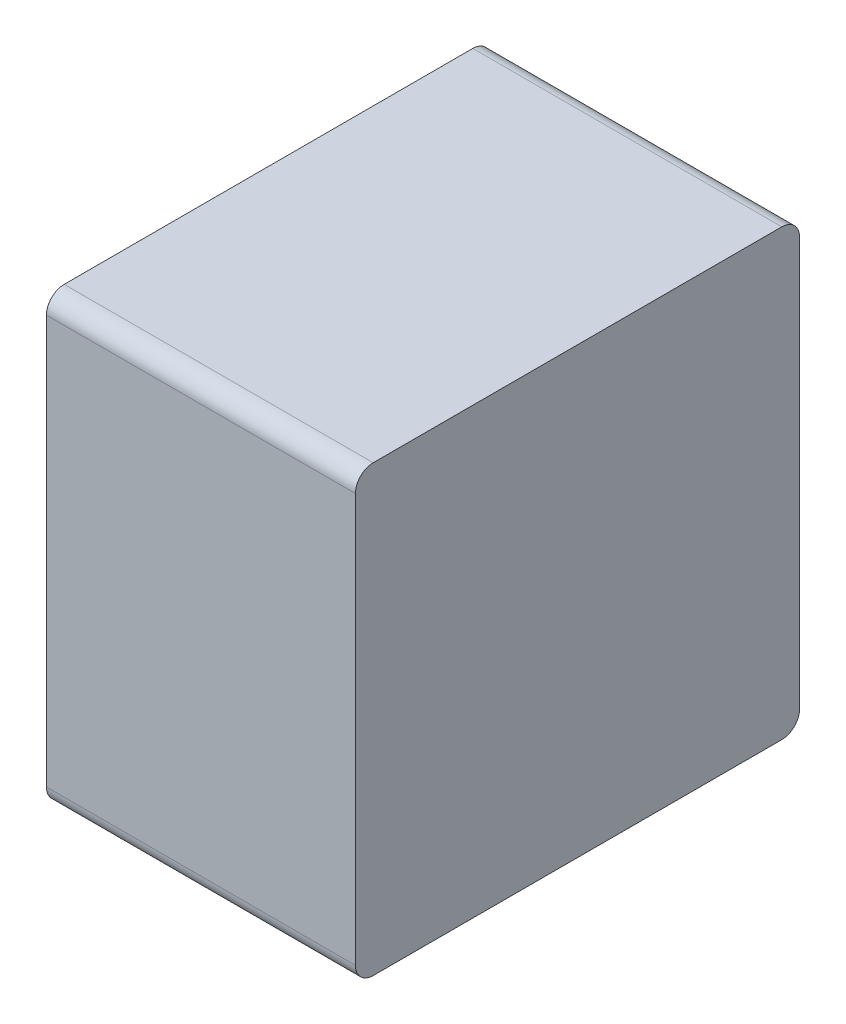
ISO-10303-21;
HEADER;
FILE_DESCRIPTION(('STEP AP214'),'2;1');
FILE_NAME('part.step','',(''),(''),'','','');
FILE_SCHEMA(('AUTOMOTIVE_DESIGN { 1 0 10303 214 1 1 1 1 }'));
ENDSEC;
DATA;
#1=APPLICATION_CONTEXT('core data for automotive mechanical design processes');
#2=APPLICATION_PROTOCOL_DEFINITION('international standard','automotive_design',2000,#1);
#3=PRODUCT_CONTEXT('',#1,'mechanical');
#4=PRODUCT('Part','Part','',(#3));
#5=PRODUCT_RELATED_PRODUCT_CATEGORY('part','',(#4));
#6=PRODUCT_DEFINITION_FORMATION('','',#4);
#7=PRODUCT_DEFINITION_CONTEXT('part definition',#1,'design');
#8=PRODUCT_DEFINITION('design','',#6,#7);
#9=PRODUCT_DEFINITION_SHAPE('','',#8);
#10=(LENGTH_UNIT() NAMED_UNIT(*) SI_UNIT(.MILLI.,.METRE.));
#11=(NAMED_UNIT(*) PLANE_ANGLE_UNIT() SI_UNIT($,.RADIAN.));
#12=(NAMED_UNIT(*) SI_UNIT($,.STERADIAN.) SOLID_ANGLE_UNIT());
#13=UNCERTAINTY_MEASURE_WITH_UNIT(LENGTH_MEASURE(1.E-05),#10,'distance_accuracy_value','');
#14=(GEOMETRIC_REPRESENTATION_CONTEXT(3) GLOBAL_UNCERTAINTY_ASSIGNED_CONTEXT((#13)) GLOBAL_UNIT_ASSIGNED_CONTEXT((#10,
#11,#12)) REPRESENTATION_CONTEXT('',''));
#15=CARTESIAN_POINT('',(0.,0.,0.));
#16=DIRECTION('',(0.,0.,1.));
#17=DIRECTION('',(1.,0.,0.));
#18=AXIS2_PLACEMENT_3D('',#15,#16,#17);
#19=CARTESIAN_POINT('',(222.032460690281,0.,50.0000000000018));
#20=DIRECTION('',(-1.,0.,0.));
#21=DIRECTION('',(0.,-1.,0.));
#22=AXIS2_PLACEMENT_3D('',#19,#20,#21);
#23=PLANE('',#22);
#24=CARTESIAN_POINT('',(222.032460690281,-57.5000000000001,55.));
#25=DIRECTION('',(-1.,0.,0.));
#26=DIRECTION('',(0.,0.,1.));
#27=AXIS2_PLACEMENT_3D('',#24,#25,#26);
#28=CIRCLE('',#27,4.99999999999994);
#29=CARTESIAN_POINT('',(222.032460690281,-57.5000000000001,50.0000000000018));
#30=VERTEX_POINT('',#29);
#31=CARTESIAN_POINT('',(222.032460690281,-62.5,55.));
#32=VERTEX_POINT('',#31);
#33=EDGE_CURVE('E84',#30,#32,#28,.T.);
#34=ORIENTED_EDGE('',*,*,#33,.T.);
#35=DIRECTION('',(0.,0.,1.));
#36=VECTOR('',#35,1.);
#37=CARTESIAN_POINT('',(222.032460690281,-62.5,112.500000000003));
#38=LINE('',#37,#36);
#39=CARTESIAN_POINT('',(222.032460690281,-62.5,170.000000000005));
#40=VERTEX_POINT('',#39);
#41=EDGE_CURVE('E79',#32,#40,#38,.T.);
#42=ORIENTED_EDGE('',*,*,#41,.T.);
#43=CARTESIAN_POINT('',(222.032460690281,-57.5,170.000000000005));
#44=DIRECTION('',(-1.,0.,0.));
#45=DIRECTION('',(0.,0.,1.));
#46=AXIS2_PLACEMENT_3D('',#43,#44,#45);
#47=CIRCLE('',#46,5.);
#48=CARTESIAN_POINT('',(222.032460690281,-57.5,175.000000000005));
#49=VERTEX_POINT('',#48);
#50=EDGE_CURVE('E20',#40,#49,#47,.T.);
#51=ORIENTED_EDGE('',*,*,#50,.T.);
#52=DIRECTION('',(0.,-1.,0.));
#53=VECTOR('',#52,1.);
#54=CARTESIAN_POINT('',(222.032460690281,0.,175.000000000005));
#55=LINE('',#54,#53);
#56=CARTESIAN_POINT('',(222.032460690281,57.5,175.000000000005));
#57=VERTEX_POINT('',#56);
#58=EDGE_CURVE('E105',#57,#49,#55,.T.);
#59=ORIENTED_EDGE('',*,*,#58,.F.);
#60=CARTESIAN_POINT('',(222.032460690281,57.4999999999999,170.000000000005));
#61=DIRECTION('',(-1.,0.,0.));
#62=DIRECTION('',(0.,0.,1.));
#63=AXIS2_PLACEMENT_3D('',#60,#61,#62);
#64=CIRCLE('',#63,5.00000000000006);
#65=CARTESIAN_POINT('',(222.032460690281,62.5,170.000000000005));
#66=VERTEX_POINT('',#65);
#67=EDGE_CURVE('E128',#57,#66,#64,.T.);
#68=ORIENTED_EDGE('',*,*,#67,.T.);
#69=DIRECTION('',(0.,0.,1.));
#70=VECTOR('',#69,1.);
#71=CARTESIAN_POINT('',(222.032460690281,62.5,112.500000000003));
#72=LINE('',#71,#70);
#73=CARTESIAN_POINT('',(222.032460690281,62.5,55.));
#74=VERTEX_POINT('',#73);
#75=EDGE_CURVE('E108',#74,#66,#72,.T.);
#76=ORIENTED_EDGE('',*,*,#75,.F.);
#77=CARTESIAN_POINT('',(222.032460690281,57.5,55.));
#78=DIRECTION('',(-1.,0.,0.));
#79=DIRECTION('',(0.,0.,1.));
#80=AXIS2_PLACEMENT_3D('',#77,#78,#79);
#81=CIRCLE('',#80,5.);
#82=CARTESIAN_POINT('',(222.032460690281,57.5,50.0000000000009));
#83=VERTEX_POINT('',#82);
#84=EDGE_CURVE('E114',#74,#83,#81,.T.);
#85=ORIENTED_EDGE('',*,*,#84,.T.);
#86=DIRECTION('',(0.,1.,0.));
#87=VECTOR('',#86,1.);
#88=CARTESIAN_POINT('',(222.032460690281,0.,50.0000000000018));
#89=LINE('',#88,#87);
#90=EDGE_CURVE('E112',#30,#83,#89,.T.);
#91=ORIENTED_EDGE('',*,*,#90,.F.);
#92=EDGE_LOOP('',(#34,#42,#51,#59,#68,#76,#85,#91));
#93=FACE_BOUND('',#92,.T.);
#94=ADVANCED_FACE('F16',(#93),#23,.T.);
#95=CARTESIAN_POINT('',(308.999999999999,-57.5,170.000000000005));
#96=DIRECTION('',(-1.,0.,0.));
#97=DIRECTION('',(0.,0.,1.));
#98=AXIS2_PLACEMENT_3D('',#95,#96,#97);
#99=CYLINDRICAL_SURFACE('',#98,5.);
#100=DIRECTION('',(1.,0.,0.));
#101=VECTOR('',#100,1.);
#102=CARTESIAN_POINT('',(235.500000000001,-57.5,175.000000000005));
#103=LINE('',#102,#101);
#104=CARTESIAN_POINT('',(308.999999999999,-57.5,175.000000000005));
#105=VERTEX_POINT('',#104);
#106=EDGE_CURVE('E94',#49,#105,#103,.T.);
#107=ORIENTED_EDGE('',*,*,#106,.F.);
#108=ORIENTED_EDGE('',*,*,#50,.F.);
#109=DIRECTION('',(1.,0.,0.));
#110=VECTOR('',#109,1.);
#111=CARTESIAN_POINT('',(265.51623034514,-62.5,170.000000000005));
#112=LINE('',#111,#110);
#113=CARTESIAN_POINT('',(308.999999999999,-62.5,170.000000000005));
#114=VERTEX_POINT('',#113);
#115=EDGE_CURVE('E88',#40,#114,#112,.T.);
#116=ORIENTED_EDGE('',*,*,#115,.T.);
#117=CARTESIAN_POINT('',(308.999999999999,-57.5,170.000000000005));
#118=DIRECTION('',(-1.,0.,0.));
#119=DIRECTION('',(0.,0.,1.));
#120=AXIS2_PLACEMENT_3D('',#117,#118,#119);
#121=CIRCLE('',#120,5.);
#122=EDGE_CURVE('E107',#105,#114,#121,.F.);
#123=ORIENTED_EDGE('',*,*,#122,.F.);
#124=EDGE_LOOP('',(#107,#108,#116,#123));
#125=FACE_BOUND('',#124,.T.);
#126=ADVANCED_FACE('F91',(#125),#99,.T.);
#127=CARTESIAN_POINT('',(265.51623034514,-62.5,112.500000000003));
#128=DIRECTION('',(0.,1.,0.));
#129=DIRECTION('',(0.,0.,1.));
#130=AXIS2_PLACEMENT_3D('',#127,#128,#129);
#131=PLANE('',#130);
#132=ORIENTED_EDGE('',*,*,#41,.F.);
#133=DIRECTION('',(-1.,0.,0.));
#134=VECTOR('',#133,1.);
#135=CARTESIAN_POINT('',(319.,-62.5,55.));
#136=LINE('',#135,#134);
#137=CARTESIAN_POINT('',(308.999999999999,-62.5,55.));
#138=VERTEX_POINT('',#137);
#139=EDGE_CURVE('E100',#32,#138,#136,.F.);
#140=ORIENTED_EDGE('',*,*,#139,.T.);
#141=DIRECTION('',(0.,0.,1.));
#142=VECTOR('',#141,1.);
#143=CARTESIAN_POINT('',(308.999999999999,-62.5,175.000000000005));
#144=LINE('',#143,#142);
#145=EDGE_CURVE('E98',#114,#138,#144,.F.);
#146=ORIENTED_EDGE('',*,*,#145,.F.);
#147=ORIENTED_EDGE('',*,*,#115,.F.);
#148=EDGE_LOOP('',(#132,#140,#146,#147));
#149=FACE_BOUND('',#148,.T.);
#150=ADVANCED_FACE('F96',(#149),#131,.F.);
#151=CARTESIAN_POINT('',(308.999999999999,-57.5000000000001,55.));
#152=DIRECTION('',(-1.,0.,0.));
#153=DIRECTION('',(0.,0.,1.));
#154=AXIS2_PLACEMENT_3D('',#151,#152,#153);
#155=CYLINDRICAL_SURFACE('',#154,4.99999999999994);
#156=DIRECTION('',(1.,0.,0.));
#157=VECTOR('',#156,1.);
#158=CARTESIAN_POINT('',(235.499999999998,-57.5,50.0000000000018));
#159=LINE('',#158,#157);
#160=CARTESIAN_POINT('',(308.999999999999,-57.5000000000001,50.0000000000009));
#161=VERTEX_POINT('',#160);
#162=EDGE_CURVE('E115',#161,#30,#159,.F.);
#163=ORIENTED_EDGE('',*,*,#162,.F.);
#164=CARTESIAN_POINT('',(308.999999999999,-57.5000000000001,55.));
#165=DIRECTION('',(-1.,0.,0.));
#166=DIRECTION('',(0.,0.,1.));
#167=AXIS2_PLACEMENT_3D('',#164,#165,#166);
#168=CIRCLE('',#167,4.99999999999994);
#169=EDGE_CURVE('E124',#138,#161,#168,.F.);
#170=ORIENTED_EDGE('',*,*,#169,.F.);
#171=ORIENTED_EDGE('',*,*,#139,.F.);
#172=ORIENTED_EDGE('',*,*,#33,.F.);
#173=EDGE_LOOP('',(#163,#170,#171,#172));
#174=FACE_BOUND('',#173,.T.);
#175=ADVANCED_FACE('F177',(#174),#155,.T.);
#176=CARTESIAN_POINT('',(235.499999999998,0.,50.0000000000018));
#177=DIRECTION('',(0.,0.,-1.));
#178=DIRECTION('',(0.,1.,0.));
#179=AXIS2_PLACEMENT_3D('',#176,#177,#178);
#180=PLANE('',#179);
#181=DIRECTION('',(-1.,0.,0.));
#182=VECTOR('',#181,1.);
#183=CARTESIAN_POINT('',(319.,57.5,50.));
#184=LINE('',#183,#182);
#185=CARTESIAN_POINT('',(308.999999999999,57.5,50.));
#186=VERTEX_POINT('',#185);
#187=EDGE_CURVE('E131',#83,#186,#184,.F.);
#188=ORIENTED_EDGE('',*,*,#187,.T.);
#189=DIRECTION('',(0.,1.,0.));
#190=VECTOR('',#189,1.);
#191=CARTESIAN_POINT('',(308.999999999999,0.,50.));
#192=LINE('',#191,#190);
#193=EDGE_CURVE('E123',#161,#186,#192,.T.);
#194=ORIENTED_EDGE('',*,*,#193,.F.);
#195=ORIENTED_EDGE('',*,*,#162,.T.);
#196=ORIENTED_EDGE('',*,*,#90,.T.);
#197=EDGE_LOOP('',(#188,#194,#195,#196));
#198=FACE_BOUND('',#197,.T.);
#199=ADVANCED_FACE('F172',(#198),#180,.T.);
#200=CARTESIAN_POINT('',(308.999999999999,57.5,55.));
#201=DIRECTION('',(-1.,0.,0.));
#202=DIRECTION('',(0.,0.,1.));
#203=AXIS2_PLACEMENT_3D('',#200,#201,#202);
#204=CYLINDRICAL_SURFACE('',#203,5.);
#205=ORIENTED_EDGE('',*,*,#187,.F.);
#206=ORIENTED_EDGE('',*,*,#84,.F.);
#207=DIRECTION('',(1.,0.,0.));
#208=VECTOR('',#207,1.);
#209=CARTESIAN_POINT('',(265.51623034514,62.5,55.));
#210=LINE('',#209,#208);
#211=CARTESIAN_POINT('',(308.999999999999,62.5,55.));
#212=VERTEX_POINT('',#211);
#213=EDGE_CURVE('E111',#212,#74,#210,.F.);
#214=ORIENTED_EDGE('',*,*,#213,.F.);
#215=CARTESIAN_POINT('',(308.999999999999,57.5,55.));
#216=DIRECTION('',(-1.,0.,0.));
#217=DIRECTION('',(0.,0.,1.));
#218=AXIS2_PLACEMENT_3D('',#215,#216,#217);
#219=CIRCLE('',#218,5.);
#220=EDGE_CURVE('E120',#186,#212,#219,.F.);
#221=ORIENTED_EDGE('',*,*,#220,.F.);
#222=EDGE_LOOP('',(#205,#206,#214,#221));
#223=FACE_BOUND('',#222,.T.);
#224=ADVANCED_FACE('F162',(#223),#204,.T.);
#225=CARTESIAN_POINT('',(265.51623034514,62.5,112.500000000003));
#226=DIRECTION('',(0.,1.,0.));
#227=DIRECTION('',(0.,0.,1.));
#228=AXIS2_PLACEMENT_3D('',#225,#226,#227);
#229=PLANE('',#228);
#230=DIRECTION('',(-1.,0.,0.));
#231=VECTOR('',#230,1.);
#232=CARTESIAN_POINT('',(319.,62.5,170.000000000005));
#233=LINE('',#232,#231);
#234=CARTESIAN_POINT('',(308.999999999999,62.5,170.000000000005));
#235=VERTEX_POINT('',#234);
#236=EDGE_CURVE('E110',#66,#235,#233,.F.);
#237=ORIENTED_EDGE('',*,*,#236,.T.);
#238=DIRECTION('',(0.,0.,1.));
#239=VECTOR('',#238,1.);
#240=CARTESIAN_POINT('',(308.999999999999,62.5,175.000000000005));
#241=LINE('',#240,#239);
#242=EDGE_CURVE('E119',#212,#235,#241,.T.);
#243=ORIENTED_EDGE('',*,*,#242,.F.);
#244=ORIENTED_EDGE('',*,*,#213,.T.);
#245=ORIENTED_EDGE('',*,*,#75,.T.);
#246=EDGE_LOOP('',(#237,#243,#244,#245));
#247=FACE_BOUND('',#246,.T.);
#248=ADVANCED_FACE('F150',(#247),#229,.T.);
#249=CARTESIAN_POINT('',(308.999999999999,57.4999999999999,170.000000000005));
#250=DIRECTION('',(-1.,0.,0.));
#251=DIRECTION('',(0.,0.,1.));
#252=AXIS2_PLACEMENT_3D('',#249,#250,#251);
#253=CYLINDRICAL_SURFACE('',#252,5.00000000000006);
#254=DIRECTION('',(1.,0.,0.));
#255=VECTOR('',#254,1.);
#256=CARTESIAN_POINT('',(235.500000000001,57.5,175.000000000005));
#257=LINE('',#256,#255);
#258=CARTESIAN_POINT('',(308.999999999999,57.5,175.000000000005));
#259=VERTEX_POINT('',#258);
#260=EDGE_CURVE('E35',#259,#57,#257,.F.);
#261=ORIENTED_EDGE('',*,*,#260,.F.);
#262=CARTESIAN_POINT('',(308.999999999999,57.4999999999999,170.000000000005));
#263=DIRECTION('',(-1.,0.,0.));
#264=DIRECTION('',(0.,0.,1.));
#265=AXIS2_PLACEMENT_3D('',#262,#263,#264);
#266=CIRCLE('',#265,5.00000000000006);
#267=EDGE_CURVE('E26',#235,#259,#266,.F.);
#268=ORIENTED_EDGE('',*,*,#267,.F.);
#269=ORIENTED_EDGE('',*,*,#236,.F.);
#270=ORIENTED_EDGE('',*,*,#67,.F.);
#271=EDGE_LOOP('',(#261,#268,#269,#270));
#272=FACE_BOUND('',#271,.T.);
#273=ADVANCED_FACE('F153',(#272),#253,.T.);
#274=CARTESIAN_POINT('',(235.500000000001,0.,175.000000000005));
#275=DIRECTION('',(0.,0.,1.));
#276=DIRECTION('',(0.,-1.,0.));
#277=AXIS2_PLACEMENT_3D('',#274,#275,#276);
#278=PLANE('',#277);
#279=ORIENTED_EDGE('',*,*,#260,.T.);
#280=ORIENTED_EDGE('',*,*,#58,.T.);
#281=ORIENTED_EDGE('',*,*,#106,.T.);
#282=DIRECTION('',(0.,1.,0.));
#283=VECTOR('',#282,1.);
#284=CARTESIAN_POINT('',(308.999999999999,0.,175.000000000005));
#285=LINE('',#284,#283);
#286=EDGE_CURVE('E10',#259,#105,#285,.F.);
#287=ORIENTED_EDGE('',*,*,#286,.F.);
#288=EDGE_LOOP('',(#279,#280,#281,#287));
#289=FACE_BOUND('',#288,.T.);
#290=ADVANCED_FACE('F155',(#289),#278,.T.);
#291=CARTESIAN_POINT('',(308.999999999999,0.,175.000000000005));
#292=DIRECTION('',(1.,0.,0.));
#293=DIRECTION('',(0.,1.,0.));
#294=AXIS2_PLACEMENT_3D('',#291,#292,#293);
#295=PLANE('',#294);
#296=ORIENTED_EDGE('',*,*,#267,.T.);
#297=ORIENTED_EDGE('',*,*,#286,.T.);
#298=ORIENTED_EDGE('',*,*,#122,.T.);
#299=ORIENTED_EDGE('',*,*,#145,.T.);
#300=ORIENTED_EDGE('',*,*,#169,.T.);
#301=ORIENTED_EDGE('',*,*,#193,.T.);
#302=ORIENTED_EDGE('',*,*,#220,.T.);
#303=ORIENTED_EDGE('',*,*,#242,.T.);
#304=EDGE_LOOP('',(#296,#297,#298,#299,#300,#301,#302,#303));
#305=FACE_BOUND('',#304,.T.);
#306=ADVANCED_FACE('F18',(#305),#295,.T.);
#307=CLOSED_SHELL('',(#94,#126,#150,#175,#199,#224,#248,#273,#290,#306));
#308=MANIFOLD_SOLID_BREP('B1',#307);
#309=ADVANCED_BREP_SHAPE_REPRESENTATION('',(#18,#308),#14);
#310=SHAPE_DEFINITION_REPRESENTATION(#9,#309);
ENDSEC;
END-ISO-10303-21;
